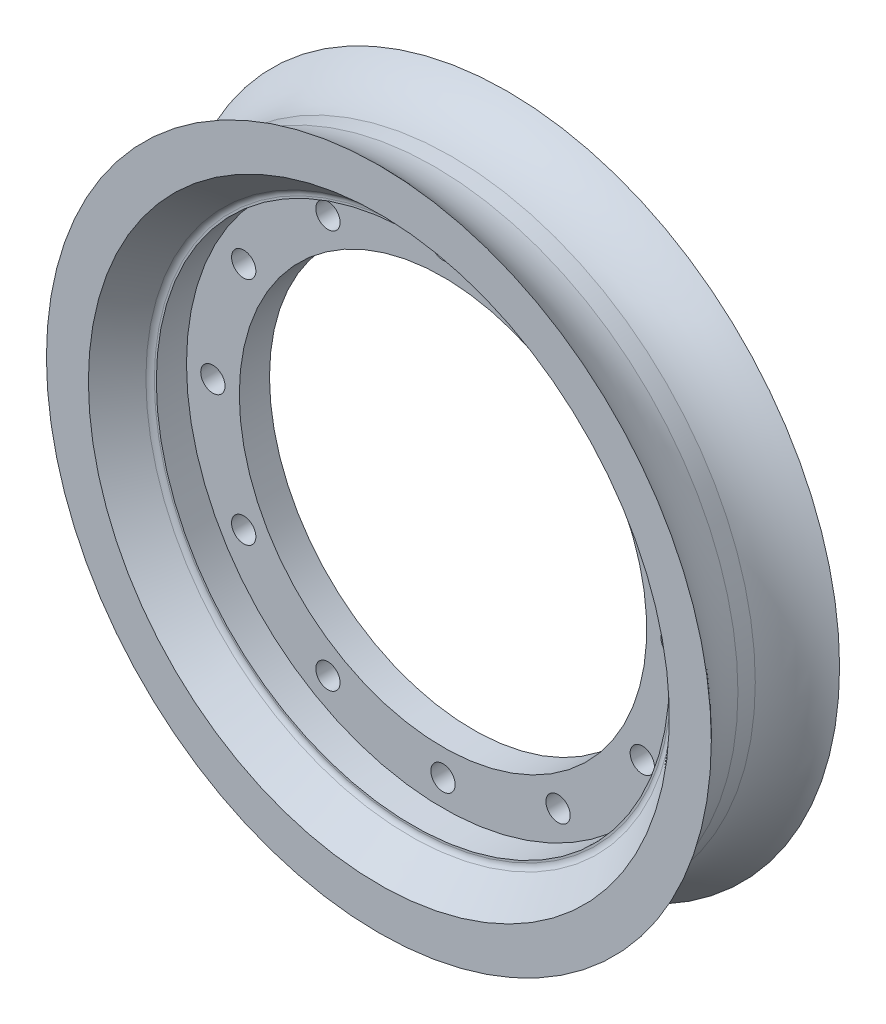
ISO-10303-21;
HEADER;
FILE_DESCRIPTION(('STEP AP214'),'2;1');
FILE_NAME('part.step','',(''),(''),'','','');
FILE_SCHEMA(('AUTOMOTIVE_DESIGN { 1 0 10303 214 1 1 1 1 }'));
ENDSEC;
DATA;
#1=APPLICATION_CONTEXT('core data for automotive mechanical design processes');
#2=APPLICATION_PROTOCOL_DEFINITION('international standard','automotive_design',2000,#1);
#3=PRODUCT_CONTEXT('',#1,'mechanical');
#4=PRODUCT('Part','Part','',(#3));
#5=PRODUCT_RELATED_PRODUCT_CATEGORY('part','',(#4));
#6=PRODUCT_DEFINITION_FORMATION('','',#4);
#7=PRODUCT_DEFINITION_CONTEXT('part definition',#1,'design');
#8=PRODUCT_DEFINITION('design','',#6,#7);
#9=PRODUCT_DEFINITION_SHAPE('','',#8);
#10=(LENGTH_UNIT() NAMED_UNIT(*) SI_UNIT(.MILLI.,.METRE.));
#11=(NAMED_UNIT(*) PLANE_ANGLE_UNIT() SI_UNIT($,.RADIAN.));
#12=(NAMED_UNIT(*) SI_UNIT($,.STERADIAN.) SOLID_ANGLE_UNIT());
#13=UNCERTAINTY_MEASURE_WITH_UNIT(LENGTH_MEASURE(1.E-05),#10,'distance_accuracy_value','');
#14=(GEOMETRIC_REPRESENTATION_CONTEXT(3) GLOBAL_UNCERTAINTY_ASSIGNED_CONTEXT((#13)) GLOBAL_UNIT_ASSIGNED_CONTEXT((#10,
#11,#12)) REPRESENTATION_CONTEXT('',''));
#15=CARTESIAN_POINT('',(0.,0.,0.));
#16=DIRECTION('',(0.,0.,1.));
#17=DIRECTION('',(1.,0.,0.));
#18=AXIS2_PLACEMENT_3D('',#15,#16,#17);
#19=CARTESIAN_POINT('',(0.,0.,42.5));
#20=DIRECTION('',(0.,0.,1.));
#21=DIRECTION('',(1.,0.,0.));
#22=AXIS2_PLACEMENT_3D('',#19,#20,#21);
#23=PLANE('',#22);
#24=CARTESIAN_POINT('',(0.,0.,42.5));
#25=DIRECTION('',(0.,0.,-1.));
#26=DIRECTION('',(-1.,0.,0.));
#27=AXIS2_PLACEMENT_3D('',#24,#25,#26);
#28=CIRCLE('',#27,220.305842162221);
#29=CARTESIAN_POINT('',(-220.305842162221,0.,42.5));
#30=VERTEX_POINT('',#29);
#31=EDGE_CURVE('E42',#30,#30,#28,.T.);
#32=ORIENTED_EDGE('',*,*,#31,.F.);
#33=EDGE_LOOP('',(#32));
#34=FACE_BOUND('',#33,.T.);
#35=CARTESIAN_POINT('',(0.,0.,42.5));
#36=DIRECTION('',(0.,0.,-1.));
#37=DIRECTION('',(-1.,0.,0.));
#38=AXIS2_PLACEMENT_3D('',#35,#36,#37);
#39=CIRCLE('',#38,192.5);
#40=CARTESIAN_POINT('',(-192.5,0.,42.5));
#41=VERTEX_POINT('',#40);
#42=EDGE_CURVE('E130',#41,#41,#39,.T.);
#43=ORIENTED_EDGE('',*,*,#42,.T.);
#44=EDGE_LOOP('',(#43));
#45=FACE_BOUND('',#44,.T.);
#46=ADVANCED_FACE('F29',(#34,#45),#23,.T.);
#47=CARTESIAN_POINT('',(0.,0.,-42.5));
#48=DIRECTION('',(0.,0.,1.));
#49=DIRECTION('',(1.,0.,0.));
#50=AXIS2_PLACEMENT_3D('',#47,#48,#49);
#51=PLANE('',#50);
#52=CARTESIAN_POINT('',(0.,0.,-42.5000000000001));
#53=DIRECTION('',(0.,0.,-1.));
#54=DIRECTION('',(-1.,0.,0.));
#55=AXIS2_PLACEMENT_3D('',#52,#53,#54);
#56=CIRCLE('',#55,220.305842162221);
#57=CARTESIAN_POINT('',(-220.305842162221,0.,-42.5000000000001));
#58=VERTEX_POINT('',#57);
#59=EDGE_CURVE('E148',#58,#58,#56,.T.);
#60=ORIENTED_EDGE('',*,*,#59,.T.);
#61=EDGE_LOOP('',(#60));
#62=FACE_BOUND('',#61,.T.);
#63=CARTESIAN_POINT('',(0.,0.,-42.5000000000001));
#64=DIRECTION('',(0.,0.,-1.));
#65=DIRECTION('',(-1.,0.,0.));
#66=AXIS2_PLACEMENT_3D('',#63,#64,#65);
#67=CIRCLE('',#66,192.5);
#68=CARTESIAN_POINT('',(-192.5,0.,-42.5000000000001));
#69=VERTEX_POINT('',#68);
#70=EDGE_CURVE('E127',#69,#69,#67,.T.);
#71=ORIENTED_EDGE('',*,*,#70,.F.);
#72=EDGE_LOOP('',(#71));
#73=FACE_BOUND('',#72,.T.);
#74=ADVANCED_FACE('F158',(#62,#73),#51,.F.);
#75=CARTESIAN_POINT('',(0.,0.,0.));
#76=DIRECTION('',(0.,0.,-1.));
#77=DIRECTION('',(-1.,0.,0.));
#78=AXIS2_PLACEMENT_3D('',#75,#76,#77);
#79=TOROIDAL_SURFACE('',#78,257.182463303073,56.2684208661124);
#80=ORIENTED_EDGE('',*,*,#31,.T.);
#81=EDGE_LOOP('',(#80));
#82=FACE_BOUND('',#81,.T.);
#83=CARTESIAN_POINT('',(0.,0.,5.74896676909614));
#84=DIRECTION('',(0.,0.,-1.));
#85=DIRECTION('',(-1.,0.,0.));
#86=AXIS2_PLACEMENT_3D('',#83,#84,#85);
#87=CIRCLE('',#86,201.2085);
#88=CARTESIAN_POINT('',(-201.2085,0.,5.74896676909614));
#89=VERTEX_POINT('',#88);
#90=EDGE_CURVE('E37',#89,#89,#87,.F.);
#91=ORIENTED_EDGE('',*,*,#90,.T.);
#92=EDGE_LOOP('',(#91));
#93=FACE_BOUND('',#92,.T.);
#94=ADVANCED_FACE('F153',(#82,#93),#79,.F.);
#95=CARTESIAN_POINT('',(0.,0.,42.5));
#96=DIRECTION('',(0.,0.,-1.));
#97=DIRECTION('',(-1.,0.,0.));
#98=AXIS2_PLACEMENT_3D('',#95,#96,#97);
#99=CYLINDRICAL_SURFACE('',#98,201.2085);
#100=ORIENTED_EDGE('',*,*,#90,.F.);
#101=EDGE_LOOP('',(#100));
#102=FACE_BOUND('',#101,.T.);
#103=CARTESIAN_POINT('',(0.,0.,-5.74896676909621));
#104=DIRECTION('',(0.,0.,1.));
#105=DIRECTION('',(1.,0.,0.));
#106=AXIS2_PLACEMENT_3D('',#103,#104,#105);
#107=CIRCLE('',#106,201.2085);
#108=CARTESIAN_POINT('',(201.2085,0.,-5.74896676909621));
#109=VERTEX_POINT('',#108);
#110=EDGE_CURVE('E10',#109,#109,#107,.F.);
#111=ORIENTED_EDGE('',*,*,#110,.F.);
#112=EDGE_LOOP('',(#111));
#113=FACE_BOUND('',#112,.T.);
#114=ADVANCED_FACE('F31',(#102,#113),#99,.T.);
#115=ORIENTED_EDGE('',*,*,#59,.F.);
#116=EDGE_LOOP('',(#115));
#117=FACE_BOUND('',#116,.T.);
#118=ORIENTED_EDGE('',*,*,#110,.T.);
#119=EDGE_LOOP('',(#118));
#120=FACE_BOUND('',#119,.T.);
#121=ADVANCED_FACE('F193',(#117,#120),#79,.F.);
#122=CARTESIAN_POINT('',(0.,0.,-21.7860619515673));
#123=DIRECTION('',(0.,0.,-1.));
#124=DIRECTION('',(-1.,0.,0.));
#125=AXIS2_PLACEMENT_3D('',#122,#123,#124);
#126=CONICAL_SURFACE('',#125,175.118942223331,0.698131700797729);
#127=ORIENTED_EDGE('',*,*,#70,.T.);
#128=EDGE_LOOP('',(#127));
#129=FACE_BOUND('',#128,.T.);
#130=CARTESIAN_POINT('',(0.,0.,-21.7860619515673));
#131=DIRECTION('',(0.,0.,-1.));
#132=DIRECTION('',(-1.,0.,0.));
#133=AXIS2_PLACEMENT_3D('',#130,#131,#132);
#134=CIRCLE('',#133,175.118942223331);
#135=CARTESIAN_POINT('',(-175.118942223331,0.,-21.7860619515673));
#136=VERTEX_POINT('',#135);
#137=EDGE_CURVE('E124',#136,#136,#134,.T.);
#138=ORIENTED_EDGE('',*,*,#137,.F.);
#139=EDGE_LOOP('',(#138));
#140=FACE_BOUND('',#139,.T.);
#141=ADVANCED_FACE('F178',(#129,#140),#126,.F.);
#142=CARTESIAN_POINT('',(0.,0.,-25.));
#143=DIRECTION('',(0.,0.,-1.));
#144=DIRECTION('',(-1.,0.,0.));
#145=AXIS2_PLACEMENT_3D('',#142,#143,#144);
#146=TOROIDAL_SURFACE('',#145,171.288720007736,5.00000000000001);
#147=ORIENTED_EDGE('',*,*,#137,.T.);
#148=EDGE_LOOP('',(#147));
#149=FACE_BOUND('',#148,.T.);
#150=CARTESIAN_POINT('',(0.,0.,-20.));
#151=DIRECTION('',(0.,0.,-1.));
#152=DIRECTION('',(-1.,0.,0.));
#153=AXIS2_PLACEMENT_3D('',#150,#151,#152);
#154=CIRCLE('',#153,171.288720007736);
#155=CARTESIAN_POINT('',(-171.288720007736,0.,-20.));
#156=VERTEX_POINT('',#155);
#157=EDGE_CURVE('E121',#156,#156,#154,.T.);
#158=ORIENTED_EDGE('',*,*,#157,.F.);
#159=EDGE_LOOP('',(#158));
#160=FACE_BOUND('',#159,.T.);
#161=ADVANCED_FACE('F208',(#149,#160),#146,.F.);
#162=CARTESIAN_POINT('',(135.,0.,-20.));
#163=DIRECTION('',(0.,0.,-1.));
#164=DIRECTION('',(-1.,0.,0.));
#165=AXIS2_PLACEMENT_3D('',#162,#163,#164);
#166=PLANE('',#165);
#167=CARTESIAN_POINT('',(76.2499999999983,132.068874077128,-20.));
#168=DIRECTION('',(0.,0.,-1.));
#169=DIRECTION('',(-1.,0.,0.));
#170=AXIS2_PLACEMENT_3D('',#167,#168,#169);
#171=CIRCLE('',#170,8.05);
#172=CARTESIAN_POINT('',(68.1999999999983,132.068874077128,-20.));
#173=VERTEX_POINT('',#172);
#174=EDGE_CURVE('E98',#173,#173,#171,.T.);
#175=ORIENTED_EDGE('',*,*,#174,.F.);
#176=EDGE_LOOP('',(#175));
#177=FACE_BOUND('',#176,.T.);
#178=CARTESIAN_POINT('',(132.068874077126,76.2500000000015,-20.));
#179=DIRECTION('',(0.,0.,-1.));
#180=DIRECTION('',(-1.,0.,0.));
#181=AXIS2_PLACEMENT_3D('',#178,#179,#180);
#182=CIRCLE('',#181,8.05);
#183=CARTESIAN_POINT('',(124.018874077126,76.2500000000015,-20.));
#184=VERTEX_POINT('',#183);
#185=EDGE_CURVE('E88',#184,#184,#182,.T.);
#186=ORIENTED_EDGE('',*,*,#185,.F.);
#187=EDGE_LOOP('',(#186));
#188=FACE_BOUND('',#187,.T.);
#189=CARTESIAN_POINT('',(152.5,1.59735363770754E-12,-20.));
#190=DIRECTION('',(0.,0.,-1.));
#191=DIRECTION('',(-1.,0.,0.));
#192=AXIS2_PLACEMENT_3D('',#189,#190,#191);
#193=CIRCLE('',#192,8.05);
#194=CARTESIAN_POINT('',(144.45,1.59735363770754E-12,-20.));
#195=VERTEX_POINT('',#194);
#196=EDGE_CURVE('E85',#195,#195,#193,.T.);
#197=ORIENTED_EDGE('',*,*,#196,.F.);
#198=EDGE_LOOP('',(#197));
#199=FACE_BOUND('',#198,.T.);
#200=CARTESIAN_POINT('',(132.068874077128,-76.2499999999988,-20.));
#201=DIRECTION('',(0.,0.,-1.));
#202=DIRECTION('',(-1.,0.,0.));
#203=AXIS2_PLACEMENT_3D('',#200,#201,#202);
#204=CIRCLE('',#203,8.05000000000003);
#205=CARTESIAN_POINT('',(124.018874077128,-76.2499999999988,-20.));
#206=VERTEX_POINT('',#205);
#207=EDGE_CURVE('E82',#206,#206,#204,.T.);
#208=ORIENTED_EDGE('',*,*,#207,.F.);
#209=EDGE_LOOP('',(#208));
#210=FACE_BOUND('',#209,.T.);
#211=CARTESIAN_POINT('',(76.2500000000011,-132.068874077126,-20.));
#212=DIRECTION('',(0.,0.,-1.));
#213=DIRECTION('',(-1.,0.,0.));
#214=AXIS2_PLACEMENT_3D('',#211,#212,#213);
#215=CIRCLE('',#214,8.05);
#216=CARTESIAN_POINT('',(68.2000000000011,-132.068874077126,-20.));
#217=VERTEX_POINT('',#216);
#218=EDGE_CURVE('E78',#217,#217,#215,.T.);
#219=ORIENTED_EDGE('',*,*,#218,.F.);
#220=EDGE_LOOP('',(#219));
#221=FACE_BOUND('',#220,.T.);
#222=CARTESIAN_POINT('',(1.06490242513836E-12,-152.5,-20.));
#223=DIRECTION('',(0.,0.,-1.));
#224=DIRECTION('',(-1.,0.,0.));
#225=AXIS2_PLACEMENT_3D('',#222,#223,#224);
#226=CIRCLE('',#225,8.05);
#227=CARTESIAN_POINT('',(-8.04999999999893,-152.5,-20.));
#228=VERTEX_POINT('',#227);
#229=EDGE_CURVE('E74',#228,#228,#226,.T.);
#230=ORIENTED_EDGE('',*,*,#229,.F.);
#231=EDGE_LOOP('',(#230));
#232=FACE_BOUND('',#231,.T.);
#233=CARTESIAN_POINT('',(-76.2499999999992,-132.068874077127,-20.));
#234=DIRECTION('',(0.,0.,-1.));
#235=DIRECTION('',(-1.,0.,0.));
#236=AXIS2_PLACEMENT_3D('',#233,#234,#235);
#237=CIRCLE('',#236,8.04999999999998);
#238=CARTESIAN_POINT('',(-84.2999999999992,-132.068874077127,-20.));
#239=VERTEX_POINT('',#238);
#240=EDGE_CURVE('E70',#239,#239,#237,.T.);
#241=ORIENTED_EDGE('',*,*,#240,.F.);
#242=EDGE_LOOP('',(#241));
#243=FACE_BOUND('',#242,.T.);
#244=CARTESIAN_POINT('',(-132.068874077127,-76.2500000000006,-20.));
#245=DIRECTION('',(0.,0.,-1.));
#246=DIRECTION('',(-1.,0.,0.));
#247=AXIS2_PLACEMENT_3D('',#244,#245,#246);
#248=CIRCLE('',#247,8.05);
#249=CARTESIAN_POINT('',(-140.118874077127,-76.2500000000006,-20.));
#250=VERTEX_POINT('',#249);
#251=EDGE_CURVE('E66',#250,#250,#248,.T.);
#252=ORIENTED_EDGE('',*,*,#251,.F.);
#253=EDGE_LOOP('',(#252));
#254=FACE_BOUND('',#253,.T.);
#255=CARTESIAN_POINT('',(-152.5,-5.32451212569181E-13,-20.));
#256=DIRECTION('',(0.,0.,-1.));
#257=DIRECTION('',(-1.,0.,0.));
#258=AXIS2_PLACEMENT_3D('',#255,#256,#257);
#259=CIRCLE('',#258,8.05);
#260=CARTESIAN_POINT('',(-160.55,-5.32451212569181E-13,-20.));
#261=VERTEX_POINT('',#260);
#262=EDGE_CURVE('E62',#261,#261,#259,.T.);
#263=ORIENTED_EDGE('',*,*,#262,.F.);
#264=EDGE_LOOP('',(#263));
#265=FACE_BOUND('',#264,.T.);
#266=CARTESIAN_POINT('',(-132.068874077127,76.2499999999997,-20.));
#267=DIRECTION('',(0.,0.,-1.));
#268=DIRECTION('',(-1.,0.,0.));
#269=AXIS2_PLACEMENT_3D('',#266,#267,#268);
#270=CIRCLE('',#269,8.04999999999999);
#271=CARTESIAN_POINT('',(-140.118874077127,76.2499999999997,-20.));
#272=VERTEX_POINT('',#271);
#273=EDGE_CURVE('E58',#272,#272,#270,.T.);
#274=ORIENTED_EDGE('',*,*,#273,.F.);
#275=EDGE_LOOP('',(#274));
#276=FACE_BOUND('',#275,.T.);
#277=CARTESIAN_POINT('',(-76.2500000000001,132.068874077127,-20.));
#278=DIRECTION('',(0.,0.,-1.));
#279=DIRECTION('',(-1.,0.,0.));
#280=AXIS2_PLACEMENT_3D('',#277,#278,#279);
#281=CIRCLE('',#280,8.05);
#282=CARTESIAN_POINT('',(-84.3000000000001,132.068874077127,-20.));
#283=VERTEX_POINT('',#282);
#284=EDGE_CURVE('E54',#283,#283,#281,.T.);
#285=ORIENTED_EDGE('',*,*,#284,.F.);
#286=EDGE_LOOP('',(#285));
#287=FACE_BOUND('',#286,.T.);
#288=CARTESIAN_POINT('',(0.,152.5,-20.));
#289=DIRECTION('',(0.,0.,-1.));
#290=DIRECTION('',(-1.,0.,0.));
#291=AXIS2_PLACEMENT_3D('',#288,#289,#290);
#292=CIRCLE('',#291,8.05);
#293=CARTESIAN_POINT('',(-8.05,152.5,-20.));
#294=VERTEX_POINT('',#293);
#295=EDGE_CURVE('E50',#294,#294,#292,.T.);
#296=ORIENTED_EDGE('',*,*,#295,.F.);
#297=EDGE_LOOP('',(#296));
#298=FACE_BOUND('',#297,.T.);
#299=ORIENTED_EDGE('',*,*,#157,.T.);
#300=EDGE_LOOP('',(#299));
#301=FACE_BOUND('',#300,.T.);
#302=CARTESIAN_POINT('',(0.,0.,-20.));
#303=DIRECTION('',(0.,0.,-1.));
#304=DIRECTION('',(-1.,0.,0.));
#305=AXIS2_PLACEMENT_3D('',#302,#303,#304);
#306=CIRCLE('',#305,135.);
#307=CARTESIAN_POINT('',(-135.,0.,-20.));
#308=VERTEX_POINT('',#307);
#309=EDGE_CURVE('E49',#308,#308,#306,.T.);
#310=ORIENTED_EDGE('',*,*,#309,.F.);
#311=EDGE_LOOP('',(#310));
#312=FACE_BOUND('',#311,.T.);
#313=ADVANCED_FACE('F190',(#177,#188,#199,#210,#221,#232,#243,#254,#265,#276,#287,#298,#301,
#312),#166,.T.);
#314=CARTESIAN_POINT('',(135.,0.,0.));
#315=DIRECTION('',(0.,0.,1.));
#316=DIRECTION('',(1.,0.,0.));
#317=AXIS2_PLACEMENT_3D('',#314,#315,#316);
#318=PLANE('',#317);
#319=CARTESIAN_POINT('',(76.2499999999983,132.068874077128,0.));
#320=DIRECTION('',(0.,0.,1.));
#321=DIRECTION('',(1.,0.,0.));
#322=AXIS2_PLACEMENT_3D('',#319,#320,#321);
#323=CIRCLE('',#322,8.05);
#324=CARTESIAN_POINT('',(84.2999999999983,132.068874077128,0.));
#325=VERTEX_POINT('',#324);
#326=EDGE_CURVE('E33',#325,#325,#323,.T.);
#327=ORIENTED_EDGE('',*,*,#326,.F.);
#328=EDGE_LOOP('',(#327));
#329=FACE_BOUND('',#328,.T.);
#330=CARTESIAN_POINT('',(132.068874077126,76.2500000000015,0.));
#331=DIRECTION('',(0.,0.,1.));
#332=DIRECTION('',(1.,0.,0.));
#333=AXIS2_PLACEMENT_3D('',#330,#331,#332);
#334=CIRCLE('',#333,8.05);
#335=CARTESIAN_POINT('',(140.118874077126,76.2500000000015,0.));
#336=VERTEX_POINT('',#335);
#337=EDGE_CURVE('E86',#336,#336,#334,.T.);
#338=ORIENTED_EDGE('',*,*,#337,.F.);
#339=EDGE_LOOP('',(#338));
#340=FACE_BOUND('',#339,.T.);
#341=CARTESIAN_POINT('',(152.5,1.59735363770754E-12,0.));
#342=DIRECTION('',(0.,0.,1.));
#343=DIRECTION('',(1.,0.,0.));
#344=AXIS2_PLACEMENT_3D('',#341,#342,#343);
#345=CIRCLE('',#344,8.05);
#346=CARTESIAN_POINT('',(160.55,1.59735363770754E-12,0.));
#347=VERTEX_POINT('',#346);
#348=EDGE_CURVE('E83',#347,#347,#345,.T.);
#349=ORIENTED_EDGE('',*,*,#348,.F.);
#350=EDGE_LOOP('',(#349));
#351=FACE_BOUND('',#350,.T.);
#352=CARTESIAN_POINT('',(132.068874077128,-76.2499999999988,0.));
#353=DIRECTION('',(0.,0.,1.));
#354=DIRECTION('',(1.,0.,0.));
#355=AXIS2_PLACEMENT_3D('',#352,#353,#354);
#356=CIRCLE('',#355,8.05000000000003);
#357=CARTESIAN_POINT('',(140.118874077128,-76.2499999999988,0.));
#358=VERTEX_POINT('',#357);
#359=EDGE_CURVE('E79',#358,#358,#356,.T.);
#360=ORIENTED_EDGE('',*,*,#359,.F.);
#361=EDGE_LOOP('',(#360));
#362=FACE_BOUND('',#361,.T.);
#363=CARTESIAN_POINT('',(76.2500000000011,-132.068874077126,0.));
#364=DIRECTION('',(0.,0.,1.));
#365=DIRECTION('',(1.,0.,0.));
#366=AXIS2_PLACEMENT_3D('',#363,#364,#365);
#367=CIRCLE('',#366,8.05);
#368=CARTESIAN_POINT('',(84.3000000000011,-132.068874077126,0.));
#369=VERTEX_POINT('',#368);
#370=EDGE_CURVE('E75',#369,#369,#367,.T.);
#371=ORIENTED_EDGE('',*,*,#370,.F.);
#372=EDGE_LOOP('',(#371));
#373=FACE_BOUND('',#372,.T.);
#374=CARTESIAN_POINT('',(1.06490242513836E-12,-152.5,0.));
#375=DIRECTION('',(0.,0.,1.));
#376=DIRECTION('',(1.,0.,0.));
#377=AXIS2_PLACEMENT_3D('',#374,#375,#376);
#378=CIRCLE('',#377,8.05);
#379=CARTESIAN_POINT('',(8.05000000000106,-152.5,0.));
#380=VERTEX_POINT('',#379);
#381=EDGE_CURVE('E71',#380,#380,#378,.T.);
#382=ORIENTED_EDGE('',*,*,#381,.F.);
#383=EDGE_LOOP('',(#382));
#384=FACE_BOUND('',#383,.T.);
#385=CARTESIAN_POINT('',(-76.2499999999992,-132.068874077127,0.));
#386=DIRECTION('',(0.,0.,1.));
#387=DIRECTION('',(1.,0.,0.));
#388=AXIS2_PLACEMENT_3D('',#385,#386,#387);
#389=CIRCLE('',#388,8.04999999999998);
#390=CARTESIAN_POINT('',(-68.1999999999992,-132.068874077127,0.));
#391=VERTEX_POINT('',#390);
#392=EDGE_CURVE('E67',#391,#391,#389,.T.);
#393=ORIENTED_EDGE('',*,*,#392,.F.);
#394=EDGE_LOOP('',(#393));
#395=FACE_BOUND('',#394,.T.);
#396=CARTESIAN_POINT('',(-132.068874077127,-76.2500000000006,0.));
#397=DIRECTION('',(0.,0.,1.));
#398=DIRECTION('',(1.,0.,0.));
#399=AXIS2_PLACEMENT_3D('',#396,#397,#398);
#400=CIRCLE('',#399,8.05);
#401=CARTESIAN_POINT('',(-124.018874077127,-76.2500000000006,0.));
#402=VERTEX_POINT('',#401);
#403=EDGE_CURVE('E63',#402,#402,#400,.T.);
#404=ORIENTED_EDGE('',*,*,#403,.F.);
#405=EDGE_LOOP('',(#404));
#406=FACE_BOUND('',#405,.T.);
#407=CARTESIAN_POINT('',(-152.5,-5.32451212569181E-13,0.));
#408=DIRECTION('',(0.,0.,1.));
#409=DIRECTION('',(1.,0.,0.));
#410=AXIS2_PLACEMENT_3D('',#407,#408,#409);
#411=CIRCLE('',#410,8.05);
#412=CARTESIAN_POINT('',(-144.45,-5.32451212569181E-13,0.));
#413=VERTEX_POINT('',#412);
#414=EDGE_CURVE('E59',#413,#413,#411,.T.);
#415=ORIENTED_EDGE('',*,*,#414,.F.);
#416=EDGE_LOOP('',(#415));
#417=FACE_BOUND('',#416,.T.);
#418=CARTESIAN_POINT('',(-132.068874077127,76.2499999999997,0.));
#419=DIRECTION('',(0.,0.,1.));
#420=DIRECTION('',(1.,0.,0.));
#421=AXIS2_PLACEMENT_3D('',#418,#419,#420);
#422=CIRCLE('',#421,8.04999999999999);
#423=CARTESIAN_POINT('',(-124.018874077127,76.2499999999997,0.));
#424=VERTEX_POINT('',#423);
#425=EDGE_CURVE('E55',#424,#424,#422,.T.);
#426=ORIENTED_EDGE('',*,*,#425,.F.);
#427=EDGE_LOOP('',(#426));
#428=FACE_BOUND('',#427,.T.);
#429=CARTESIAN_POINT('',(-76.2500000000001,132.068874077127,0.));
#430=DIRECTION('',(0.,0.,1.));
#431=DIRECTION('',(1.,0.,0.));
#432=AXIS2_PLACEMENT_3D('',#429,#430,#431);
#433=CIRCLE('',#432,8.05);
#434=CARTESIAN_POINT('',(-68.2000000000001,132.068874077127,0.));
#435=VERTEX_POINT('',#434);
#436=EDGE_CURVE('E51',#435,#435,#433,.T.);
#437=ORIENTED_EDGE('',*,*,#436,.F.);
#438=EDGE_LOOP('',(#437));
#439=FACE_BOUND('',#438,.T.);
#440=CARTESIAN_POINT('',(0.,152.5,0.));
#441=DIRECTION('',(0.,0.,1.));
#442=DIRECTION('',(1.,0.,0.));
#443=AXIS2_PLACEMENT_3D('',#440,#441,#442);
#444=CIRCLE('',#443,8.05);
#445=CARTESIAN_POINT('',(8.05,152.5,0.));
#446=VERTEX_POINT('',#445);
#447=EDGE_CURVE('E46',#446,#446,#444,.T.);
#448=ORIENTED_EDGE('',*,*,#447,.F.);
#449=EDGE_LOOP('',(#448));
#450=FACE_BOUND('',#449,.T.);
#451=CARTESIAN_POINT('',(0.,0.,0.));
#452=DIRECTION('',(0.,0.,-1.));
#453=DIRECTION('',(-1.,0.,0.));
#454=AXIS2_PLACEMENT_3D('',#451,#452,#453);
#455=CIRCLE('',#454,135.);
#456=CARTESIAN_POINT('',(-135.,0.,0.));
#457=VERTEX_POINT('',#456);
#458=EDGE_CURVE('E145',#457,#457,#455,.T.);
#459=ORIENTED_EDGE('',*,*,#458,.T.);
#460=EDGE_LOOP('',(#459));
#461=FACE_BOUND('',#460,.T.);
#462=CARTESIAN_POINT('',(0.,0.,0.));
#463=DIRECTION('',(0.,0.,-1.));
#464=DIRECTION('',(-1.,0.,0.));
#465=AXIS2_PLACEMENT_3D('',#462,#463,#464);
#466=CIRCLE('',#465,170.);
#467=CARTESIAN_POINT('',(-170.,0.,0.));
#468=VERTEX_POINT('',#467);
#469=EDGE_CURVE('E142',#468,#468,#466,.T.);
#470=ORIENTED_EDGE('',*,*,#469,.F.);
#471=EDGE_LOOP('',(#470));
#472=FACE_BOUND('',#471,.T.);
#473=ADVANCED_FACE('F187',(#329,#340,#351,#362,#373,#384,#395,#406,#417,#428,#439,#450,#461,
#472),#318,.T.);
#474=CARTESIAN_POINT('',(0.,0.,-131.640619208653));
#475=DIRECTION('',(0.,0.,-1.));
#476=DIRECTION('',(-1.,0.,0.));
#477=AXIS2_PLACEMENT_3D('',#474,#475,#476);
#478=CYLINDRICAL_SURFACE('',#477,170.);
#479=ORIENTED_EDGE('',*,*,#469,.T.);
#480=EDGE_LOOP('',(#479));
#481=FACE_BOUND('',#480,.T.);
#482=CARTESIAN_POINT('',(0.,0.,20.));
#483=DIRECTION('',(0.,0.,-1.));
#484=DIRECTION('',(-1.,0.,0.));
#485=AXIS2_PLACEMENT_3D('',#482,#483,#484);
#486=CIRCLE('',#485,170.);
#487=CARTESIAN_POINT('',(-170.,0.,20.));
#488=VERTEX_POINT('',#487);
#489=EDGE_CURVE('E139',#488,#488,#486,.T.);
#490=ORIENTED_EDGE('',*,*,#489,.F.);
#491=EDGE_LOOP('',(#490));
#492=FACE_BOUND('',#491,.T.);
#493=ADVANCED_FACE('F183',(#481,#492),#478,.F.);
#494=CARTESIAN_POINT('',(171.288720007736,0.,20.));
#495=DIRECTION('',(0.,0.,1.));
#496=DIRECTION('',(1.,0.,0.));
#497=AXIS2_PLACEMENT_3D('',#494,#495,#496);
#498=PLANE('',#497);
#499=ORIENTED_EDGE('',*,*,#489,.T.);
#500=EDGE_LOOP('',(#499));
#501=FACE_BOUND('',#500,.T.);
#502=CARTESIAN_POINT('',(0.,0.,20.));
#503=DIRECTION('',(0.,0.,-1.));
#504=DIRECTION('',(-1.,0.,0.));
#505=AXIS2_PLACEMENT_3D('',#502,#503,#504);
#506=CIRCLE('',#505,171.288720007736);
#507=CARTESIAN_POINT('',(-171.288720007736,0.,20.));
#508=VERTEX_POINT('',#507);
#509=EDGE_CURVE('E136',#508,#508,#506,.T.);
#510=ORIENTED_EDGE('',*,*,#509,.F.);
#511=EDGE_LOOP('',(#510));
#512=FACE_BOUND('',#511,.T.);
#513=ADVANCED_FACE('F174',(#501,#512),#498,.T.);
#514=CARTESIAN_POINT('',(0.,0.,25.));
#515=DIRECTION('',(0.,0.,-1.));
#516=DIRECTION('',(-1.,0.,0.));
#517=AXIS2_PLACEMENT_3D('',#514,#515,#516);
#518=TOROIDAL_SURFACE('',#517,171.288720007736,5.00000000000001);
#519=ORIENTED_EDGE('',*,*,#509,.T.);
#520=EDGE_LOOP('',(#519));
#521=FACE_BOUND('',#520,.T.);
#522=CARTESIAN_POINT('',(0.,0.,21.7860619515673));
#523=DIRECTION('',(0.,0.,-1.));
#524=DIRECTION('',(-1.,0.,0.));
#525=AXIS2_PLACEMENT_3D('',#522,#523,#524);
#526=CIRCLE('',#525,175.118942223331);
#527=CARTESIAN_POINT('',(-175.118942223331,0.,21.7860619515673));
#528=VERTEX_POINT('',#527);
#529=EDGE_CURVE('E133',#528,#528,#526,.T.);
#530=ORIENTED_EDGE('',*,*,#529,.F.);
#531=EDGE_LOOP('',(#530));
#532=FACE_BOUND('',#531,.T.);
#533=ADVANCED_FACE('F164',(#521,#532),#518,.F.);
#534=CARTESIAN_POINT('',(0.,0.,42.5));
#535=DIRECTION('',(0.,0.,1.));
#536=DIRECTION('',(1.,0.,0.));
#537=AXIS2_PLACEMENT_3D('',#534,#535,#536);
#538=CONICAL_SURFACE('',#537,192.5,0.69813170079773);
#539=ORIENTED_EDGE('',*,*,#529,.T.);
#540=EDGE_LOOP('',(#539));
#541=FACE_BOUND('',#540,.T.);
#542=ORIENTED_EDGE('',*,*,#42,.F.);
#543=EDGE_LOOP('',(#542));
#544=FACE_BOUND('',#543,.T.);
#545=ADVANCED_FACE('F161',(#541,#544),#538,.F.);
#546=CARTESIAN_POINT('',(0.,0.,42.5));
#547=DIRECTION('',(0.,0.,-1.));
#548=DIRECTION('',(-1.,0.,0.));
#549=AXIS2_PLACEMENT_3D('',#546,#547,#548);
#550=CYLINDRICAL_SURFACE('',#549,135.);
#551=ORIENTED_EDGE('',*,*,#309,.T.);
#552=EDGE_LOOP('',(#551));
#553=FACE_BOUND('',#552,.T.);
#554=ORIENTED_EDGE('',*,*,#458,.F.);
#555=EDGE_LOOP('',(#554));
#556=FACE_BOUND('',#555,.T.);
#557=ADVANCED_FACE('F163',(#553,#556),#550,.F.);
#558=CARTESIAN_POINT('',(0.,152.5,42.5));
#559=DIRECTION('',(0.,0.,-1.));
#560=DIRECTION('',(-1.,0.,0.));
#561=AXIS2_PLACEMENT_3D('',#558,#559,#560);
#562=CYLINDRICAL_SURFACE('',#561,8.05);
#563=ORIENTED_EDGE('',*,*,#447,.T.);
#564=EDGE_LOOP('',(#563));
#565=FACE_BOUND('',#564,.T.);
#566=ORIENTED_EDGE('',*,*,#295,.T.);
#567=EDGE_LOOP('',(#566));
#568=FACE_BOUND('',#567,.T.);
#569=ADVANCED_FACE('F171',(#565,#568),#562,.F.);
#570=CARTESIAN_POINT('',(-76.2500000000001,132.068874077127,42.5));
#571=DIRECTION('',(0.,0.,-1.));
#572=DIRECTION('',(-1.,0.,0.));
#573=AXIS2_PLACEMENT_3D('',#570,#571,#572);
#574=CYLINDRICAL_SURFACE('',#573,8.05);
#575=ORIENTED_EDGE('',*,*,#436,.T.);
#576=EDGE_LOOP('',(#575));
#577=FACE_BOUND('',#576,.T.);
#578=ORIENTED_EDGE('',*,*,#284,.T.);
#579=EDGE_LOOP('',(#578));
#580=FACE_BOUND('',#579,.T.);
#581=ADVANCED_FACE('F238',(#577,#580),#574,.F.);
#582=CARTESIAN_POINT('',(-132.068874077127,76.2499999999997,42.5));
#583=DIRECTION('',(0.,0.,-1.));
#584=DIRECTION('',(-1.,0.,0.));
#585=AXIS2_PLACEMENT_3D('',#582,#583,#584);
#586=CYLINDRICAL_SURFACE('',#585,8.04999999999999);
#587=ORIENTED_EDGE('',*,*,#425,.T.);
#588=EDGE_LOOP('',(#587));
#589=FACE_BOUND('',#588,.T.);
#590=ORIENTED_EDGE('',*,*,#273,.T.);
#591=EDGE_LOOP('',(#590));
#592=FACE_BOUND('',#591,.T.);
#593=ADVANCED_FACE('F242',(#589,#592),#586,.F.);
#594=CARTESIAN_POINT('',(-152.5,-5.32451212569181E-13,42.5));
#595=DIRECTION('',(0.,0.,-1.));
#596=DIRECTION('',(-1.,0.,0.));
#597=AXIS2_PLACEMENT_3D('',#594,#595,#596);
#598=CYLINDRICAL_SURFACE('',#597,8.05);
#599=ORIENTED_EDGE('',*,*,#414,.T.);
#600=EDGE_LOOP('',(#599));
#601=FACE_BOUND('',#600,.T.);
#602=ORIENTED_EDGE('',*,*,#262,.T.);
#603=EDGE_LOOP('',(#602));
#604=FACE_BOUND('',#603,.T.);
#605=ADVANCED_FACE('F246',(#601,#604),#598,.F.);
#606=CARTESIAN_POINT('',(-132.068874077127,-76.2500000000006,42.5));
#607=DIRECTION('',(0.,0.,-1.));
#608=DIRECTION('',(-1.,0.,0.));
#609=AXIS2_PLACEMENT_3D('',#606,#607,#608);
#610=CYLINDRICAL_SURFACE('',#609,8.05);
#611=ORIENTED_EDGE('',*,*,#403,.T.);
#612=EDGE_LOOP('',(#611));
#613=FACE_BOUND('',#612,.T.);
#614=ORIENTED_EDGE('',*,*,#251,.T.);
#615=EDGE_LOOP('',(#614));
#616=FACE_BOUND('',#615,.T.);
#617=ADVANCED_FACE('F250',(#613,#616),#610,.F.);
#618=CARTESIAN_POINT('',(-76.2499999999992,-132.068874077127,42.5));
#619=DIRECTION('',(0.,0.,-1.));
#620=DIRECTION('',(-1.,0.,0.));
#621=AXIS2_PLACEMENT_3D('',#618,#619,#620);
#622=CYLINDRICAL_SURFACE('',#621,8.04999999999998);
#623=ORIENTED_EDGE('',*,*,#392,.T.);
#624=EDGE_LOOP('',(#623));
#625=FACE_BOUND('',#624,.T.);
#626=ORIENTED_EDGE('',*,*,#240,.T.);
#627=EDGE_LOOP('',(#626));
#628=FACE_BOUND('',#627,.T.);
#629=ADVANCED_FACE('F254',(#625,#628),#622,.F.);
#630=CARTESIAN_POINT('',(1.06490242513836E-12,-152.5,42.5));
#631=DIRECTION('',(0.,0.,-1.));
#632=DIRECTION('',(-1.,0.,0.));
#633=AXIS2_PLACEMENT_3D('',#630,#631,#632);
#634=CYLINDRICAL_SURFACE('',#633,8.05);
#635=ORIENTED_EDGE('',*,*,#381,.T.);
#636=EDGE_LOOP('',(#635));
#637=FACE_BOUND('',#636,.T.);
#638=ORIENTED_EDGE('',*,*,#229,.T.);
#639=EDGE_LOOP('',(#638));
#640=FACE_BOUND('',#639,.T.);
#641=ADVANCED_FACE('F258',(#637,#640),#634,.F.);
#642=CARTESIAN_POINT('',(76.2500000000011,-132.068874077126,42.5));
#643=DIRECTION('',(0.,0.,-1.));
#644=DIRECTION('',(-1.,0.,0.));
#645=AXIS2_PLACEMENT_3D('',#642,#643,#644);
#646=CYLINDRICAL_SURFACE('',#645,8.05);
#647=ORIENTED_EDGE('',*,*,#370,.T.);
#648=EDGE_LOOP('',(#647));
#649=FACE_BOUND('',#648,.T.);
#650=ORIENTED_EDGE('',*,*,#218,.T.);
#651=EDGE_LOOP('',(#650));
#652=FACE_BOUND('',#651,.T.);
#653=ADVANCED_FACE('F262',(#649,#652),#646,.F.);
#654=CARTESIAN_POINT('',(132.068874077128,-76.2499999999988,42.5));
#655=DIRECTION('',(0.,0.,-1.));
#656=DIRECTION('',(-1.,0.,0.));
#657=AXIS2_PLACEMENT_3D('',#654,#655,#656);
#658=CYLINDRICAL_SURFACE('',#657,8.05000000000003);
#659=ORIENTED_EDGE('',*,*,#359,.T.);
#660=EDGE_LOOP('',(#659));
#661=FACE_BOUND('',#660,.T.);
#662=ORIENTED_EDGE('',*,*,#207,.T.);
#663=EDGE_LOOP('',(#662));
#664=FACE_BOUND('',#663,.T.);
#665=ADVANCED_FACE('F266',(#661,#664),#658,.F.);
#666=CARTESIAN_POINT('',(152.5,1.59735363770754E-12,42.5));
#667=DIRECTION('',(0.,0.,-1.));
#668=DIRECTION('',(-1.,0.,0.));
#669=AXIS2_PLACEMENT_3D('',#666,#667,#668);
#670=CYLINDRICAL_SURFACE('',#669,8.05);
#671=ORIENTED_EDGE('',*,*,#348,.T.);
#672=EDGE_LOOP('',(#671));
#673=FACE_BOUND('',#672,.T.);
#674=ORIENTED_EDGE('',*,*,#196,.T.);
#675=EDGE_LOOP('',(#674));
#676=FACE_BOUND('',#675,.T.);
#677=ADVANCED_FACE('F270',(#673,#676),#670,.F.);
#678=CARTESIAN_POINT('',(132.068874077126,76.2500000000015,42.5));
#679=DIRECTION('',(0.,0.,-1.));
#680=DIRECTION('',(-1.,0.,0.));
#681=AXIS2_PLACEMENT_3D('',#678,#679,#680);
#682=CYLINDRICAL_SURFACE('',#681,8.05);
#683=ORIENTED_EDGE('',*,*,#337,.T.);
#684=EDGE_LOOP('',(#683));
#685=FACE_BOUND('',#684,.T.);
#686=ORIENTED_EDGE('',*,*,#185,.T.);
#687=EDGE_LOOP('',(#686));
#688=FACE_BOUND('',#687,.T.);
#689=ADVANCED_FACE('F274',(#685,#688),#682,.F.);
#690=CARTESIAN_POINT('',(76.2499999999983,132.068874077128,42.5));
#691=DIRECTION('',(0.,0.,-1.));
#692=DIRECTION('',(-1.,0.,0.));
#693=AXIS2_PLACEMENT_3D('',#690,#691,#692);
#694=CYLINDRICAL_SURFACE('',#693,8.05);
#695=ORIENTED_EDGE('',*,*,#326,.T.);
#696=EDGE_LOOP('',(#695));
#697=FACE_BOUND('',#696,.T.);
#698=ORIENTED_EDGE('',*,*,#174,.T.);
#699=EDGE_LOOP('',(#698));
#700=FACE_BOUND('',#699,.T.);
#701=ADVANCED_FACE('F278',(#697,#700),#694,.F.);
#702=CLOSED_SHELL('',(#46,#74,#94,#114,#121,#141,#161,#313,#473,#493,#513,#533,#545,#557,#569,
#581,#593,#605,#617,#629,#641,#653,#665,#677,#689,#701));
#703=MANIFOLD_SOLID_BREP('B2',#702);
#704=ADVANCED_BREP_SHAPE_REPRESENTATION('',(#18,#703),#14);
#705=SHAPE_DEFINITION_REPRESENTATION(#9,#704);
ENDSEC;
END-ISO-10303-21;
